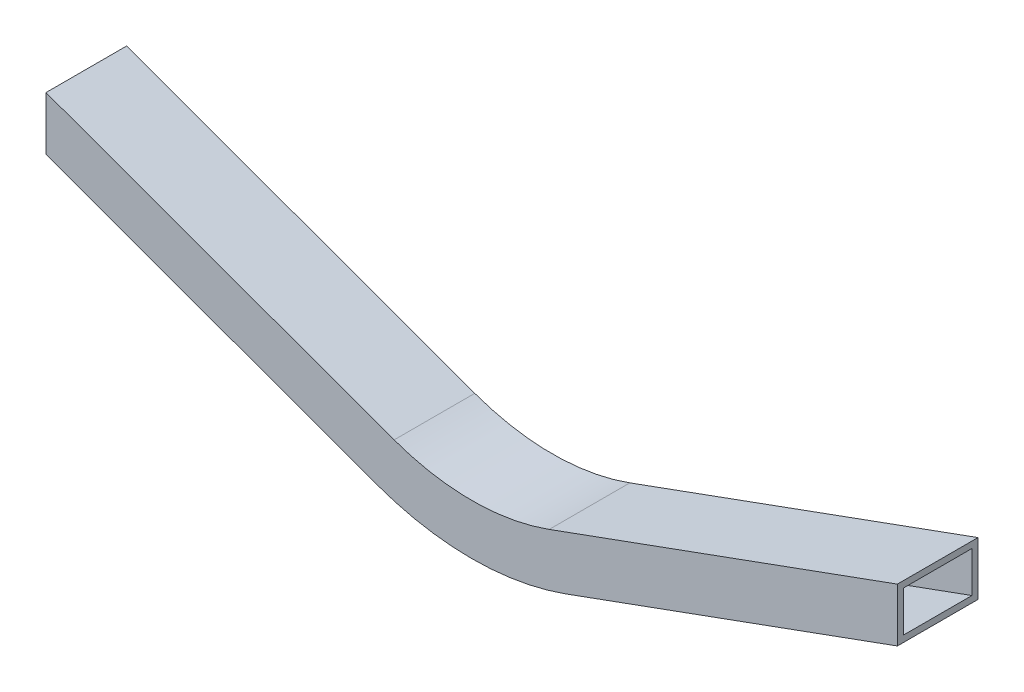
ISO-10303-21;
HEADER;
FILE_DESCRIPTION(('STEP AP214'),'2;1');
FILE_NAME('part.step','',(''),(''),'','','');
FILE_SCHEMA(('AUTOMOTIVE_DESIGN { 1 0 10303 214 1 1 1 1 }'));
ENDSEC;
DATA;
#1=APPLICATION_CONTEXT('core data for automotive mechanical design processes');
#2=APPLICATION_PROTOCOL_DEFINITION('international standard','automotive_design',2000,#1);
#3=PRODUCT_CONTEXT('',#1,'mechanical');
#4=PRODUCT('Part','Part','',(#3));
#5=PRODUCT_RELATED_PRODUCT_CATEGORY('part','',(#4));
#6=PRODUCT_DEFINITION_FORMATION('','',#4);
#7=PRODUCT_DEFINITION_CONTEXT('part definition',#1,'design');
#8=PRODUCT_DEFINITION('design','',#6,#7);
#9=PRODUCT_DEFINITION_SHAPE('','',#8);
#10=(LENGTH_UNIT() NAMED_UNIT(*) SI_UNIT(.MILLI.,.METRE.));
#11=(NAMED_UNIT(*) PLANE_ANGLE_UNIT() SI_UNIT($,.RADIAN.));
#12=(NAMED_UNIT(*) SI_UNIT($,.STERADIAN.) SOLID_ANGLE_UNIT());
#13=UNCERTAINTY_MEASURE_WITH_UNIT(LENGTH_MEASURE(1.E-05),#10,'distance_accuracy_value','');
#14=(GEOMETRIC_REPRESENTATION_CONTEXT(3) GLOBAL_UNCERTAINTY_ASSIGNED_CONTEXT((#13)) GLOBAL_UNIT_ASSIGNED_CONTEXT((#10,
#11,#12)) REPRESENTATION_CONTEXT('',''));
#15=CARTESIAN_POINT('',(0.,0.,0.));
#16=DIRECTION('',(0.,0.,1.));
#17=DIRECTION('',(1.,0.,0.));
#18=AXIS2_PLACEMENT_3D('',#15,#16,#17);
#19=CARTESIAN_POINT('',(76.9545322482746,54.6136034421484,-40.));
#20=DIRECTION('',(0.342020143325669,-0.939692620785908,0.));
#21=DIRECTION('',(0.939692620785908,0.342020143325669,0.));
#22=AXIS2_PLACEMENT_3D('',#19,#20,#21);
#23=PLANE('',#22);
#24=DIRECTION('',(0.,0.,1.));
#25=VECTOR('',#24,1.);
#26=CARTESIAN_POINT('',(422.499999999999,180.381868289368,-40.));
#27=LINE('',#26,#25);
#28=CARTESIAN_POINT('',(422.499999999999,180.381868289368,-40.));
#29=VERTEX_POINT('',#28);
#30=CARTESIAN_POINT('',(422.499999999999,180.381868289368,40.));
#31=VERTEX_POINT('',#30);
#32=EDGE_CURVE('E366',#29,#31,#27,.T.);
#33=ORIENTED_EDGE('',*,*,#32,.F.);
#34=DIRECTION('',(0.939692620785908,0.342020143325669,0.));
#35=VECTOR('',#34,1.);
#36=CARTESIAN_POINT('',(76.9545322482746,54.6136034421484,-40.));
#37=LINE('',#36,#35);
#38=CARTESIAN_POINT('',(76.9545322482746,54.6136034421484,-40.));
#39=VERTEX_POINT('',#38);
#40=EDGE_CURVE('E523',#39,#29,#37,.T.);
#41=ORIENTED_EDGE('',*,*,#40,.F.);
#42=DIRECTION('',(0.,0.,-1.));
#43=VECTOR('',#42,1.);
#44=CARTESIAN_POINT('',(76.9545322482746,54.6136034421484,-40.));
#45=LINE('',#44,#43);
#46=CARTESIAN_POINT('',(76.9545322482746,54.6136034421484,40.));
#47=VERTEX_POINT('',#46);
#48=EDGE_CURVE('E501',#47,#39,#45,.T.);
#49=ORIENTED_EDGE('',*,*,#48,.F.);
#50=DIRECTION('',(0.939692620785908,0.342020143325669,0.));
#51=VECTOR('',#50,1.);
#52=CARTESIAN_POINT('',(76.9545322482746,54.6136034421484,40.));
#53=LINE('',#52,#51);
#54=EDGE_CURVE('E520',#47,#31,#53,.T.);
#55=ORIENTED_EDGE('',*,*,#54,.T.);
#56=EDGE_LOOP('',(#33,#41,#49,#55));
#57=FACE_BOUND('',#56,.T.);
#58=ADVANCED_FACE('F352',(#57),#23,.F.);
#59=CARTESIAN_POINT('',(94.0555394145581,7.62897240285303,-40.));
#60=DIRECTION('',(-0.342020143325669,0.939692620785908,0.));
#61=DIRECTION('',(-0.939692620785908,-0.342020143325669,0.));
#62=AXIS2_PLACEMENT_3D('',#59,#60,#61);
#63=PLANE('',#62);
#64=DIRECTION('',(0.,0.,-1.));
#65=VECTOR('',#64,1.);
#66=CARTESIAN_POINT('',(422.499999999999,127.172979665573,-40.));
#67=LINE('',#66,#65);
#68=CARTESIAN_POINT('',(422.499999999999,127.172979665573,40.));
#69=VERTEX_POINT('',#68);
#70=CARTESIAN_POINT('',(422.499999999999,127.172979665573,-40.));
#71=VERTEX_POINT('',#70);
#72=EDGE_CURVE('E586',#69,#71,#67,.T.);
#73=ORIENTED_EDGE('',*,*,#72,.F.);
#74=DIRECTION('',(0.939692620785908,0.342020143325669,0.));
#75=VECTOR('',#74,1.);
#76=CARTESIAN_POINT('',(94.0555394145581,7.62897240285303,40.));
#77=LINE('',#76,#75);
#78=CARTESIAN_POINT('',(94.0555394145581,7.62897240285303,40.));
#79=VERTEX_POINT('',#78);
#80=EDGE_CURVE('E517',#79,#69,#77,.T.);
#81=ORIENTED_EDGE('',*,*,#80,.F.);
#82=DIRECTION('',(0.,0.,1.));
#83=VECTOR('',#82,1.);
#84=CARTESIAN_POINT('',(94.0555394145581,7.62897240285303,-40.));
#85=LINE('',#84,#83);
#86=CARTESIAN_POINT('',(94.0555394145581,7.62897240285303,-40.));
#87=VERTEX_POINT('',#86);
#88=EDGE_CURVE('E490',#87,#79,#85,.T.);
#89=ORIENTED_EDGE('',*,*,#88,.F.);
#90=DIRECTION('',(0.939692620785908,0.342020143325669,0.));
#91=VECTOR('',#90,1.);
#92=CARTESIAN_POINT('',(94.0555394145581,7.62897240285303,-40.));
#93=LINE('',#92,#91);
#94=EDGE_CURVE('E514',#87,#71,#93,.T.);
#95=ORIENTED_EDGE('',*,*,#94,.T.);
#96=EDGE_LOOP('',(#73,#81,#89,#95));
#97=FACE_BOUND('',#96,.T.);
#98=ADVANCED_FACE('F644',(#97),#63,.F.);
#99=CARTESIAN_POINT('',(-76.9545322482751,54.6136034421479,-40.));
#100=DIRECTION('',(0.,0.,-1.));
#101=DIRECTION('',(0.,1.,0.));
#102=AXIS2_PLACEMENT_3D('',#99,#100,#101);
#103=PLANE('',#102);
#104=DIRECTION('',(-0.939692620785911,0.342020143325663,0.));
#105=VECTOR('',#104,1.);
#106=CARTESIAN_POINT('',(-94.0555394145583,7.62897240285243,-40.));
#107=LINE('',#106,#105);
#108=CARTESIAN_POINT('',(-94.0555394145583,7.62897240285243,-40.));
#109=VERTEX_POINT('',#108);
#110=CARTESIAN_POINT('',(-422.500000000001,127.17297966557,-40.));
#111=VERTEX_POINT('',#110);
#112=EDGE_CURVE('E492',#109,#111,#107,.T.);
#113=ORIENTED_EDGE('',*,*,#112,.T.);
#114=DIRECTION('',(0.,-1.,0.));
#115=VECTOR('',#114,1.);
#116=CARTESIAN_POINT('',(-422.500000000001,372.439072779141,-40.));
#117=LINE('',#116,#115);
#118=CARTESIAN_POINT('',(-422.500000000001,180.381868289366,-40.));
#119=VERTEX_POINT('',#118);
#120=EDGE_CURVE('E374',#119,#111,#117,.T.);
#121=ORIENTED_EDGE('',*,*,#120,.F.);
#122=DIRECTION('',(-0.939692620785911,0.342020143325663,0.));
#123=VECTOR('',#122,1.);
#124=CARTESIAN_POINT('',(-76.9545322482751,54.6136034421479,-40.));
#125=LINE('',#124,#123);
#126=CARTESIAN_POINT('',(-76.9545322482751,54.6136034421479,-40.));
#127=VERTEX_POINT('',#126);
#128=EDGE_CURVE('E481',#127,#119,#125,.T.);
#129=ORIENTED_EDGE('',*,*,#128,.F.);
#130=CARTESIAN_POINT('',(-9.59302082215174E-13,266.044443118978,-40.));
#131=DIRECTION('',(0.,0.,1.));
#132=DIRECTION('',(1.,0.,0.));
#133=AXIS2_PLACEMENT_3D('',#130,#131,#132);
#134=CIRCLE('',#133,225.);
#135=EDGE_CURVE('E511',#127,#39,#134,.T.);
#136=ORIENTED_EDGE('',*,*,#135,.T.);
#137=ORIENTED_EDGE('',*,*,#40,.T.);
#138=DIRECTION('',(0.,1.,0.));
#139=VECTOR('',#138,1.);
#140=CARTESIAN_POINT('',(422.499999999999,372.439072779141,-40.));
#141=LINE('',#140,#139);
#142=EDGE_CURVE('E543',#71,#29,#141,.T.);
#143=ORIENTED_EDGE('',*,*,#142,.F.);
#144=ORIENTED_EDGE('',*,*,#94,.F.);
#145=CARTESIAN_POINT('',(-9.59302082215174E-13,266.044443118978,-40.));
#146=DIRECTION('',(0.,0.,1.));
#147=DIRECTION('',(1.,0.,0.));
#148=AXIS2_PLACEMENT_3D('',#145,#146,#147);
#149=CIRCLE('',#148,275.);
#150=EDGE_CURVE('E504',#109,#87,#149,.T.);
#151=ORIENTED_EDGE('',*,*,#150,.F.);
#152=EDGE_LOOP('',(#113,#121,#129,#136,#137,#143,#144,#151));
#153=FACE_BOUND('',#152,.T.);
#154=ADVANCED_FACE('F568',(#153),#103,.T.);
#155=CARTESIAN_POINT('',(-76.9545322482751,54.6136034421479,-40.));
#156=DIRECTION('',(0.342020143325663,0.939692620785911,0.));
#157=DIRECTION('',(-0.939692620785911,0.342020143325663,0.));
#158=AXIS2_PLACEMENT_3D('',#155,#156,#157);
#159=PLANE('',#158);
#160=ORIENTED_EDGE('',*,*,#128,.T.);
#161=DIRECTION('',(0.,0.,1.));
#162=VECTOR('',#161,1.);
#163=CARTESIAN_POINT('',(-422.500000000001,180.381868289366,-40.));
#164=LINE('',#163,#162);
#165=CARTESIAN_POINT('',(-422.500000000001,180.381868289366,40.));
#166=VERTEX_POINT('',#165);
#167=EDGE_CURVE('E466',#119,#166,#164,.T.);
#168=ORIENTED_EDGE('',*,*,#167,.T.);
#169=DIRECTION('',(-0.939692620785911,0.342020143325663,0.));
#170=VECTOR('',#169,1.);
#171=CARTESIAN_POINT('',(-76.9545322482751,54.6136034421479,40.));
#172=LINE('',#171,#170);
#173=CARTESIAN_POINT('',(-76.9545322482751,54.6136034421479,40.));
#174=VERTEX_POINT('',#173);
#175=EDGE_CURVE('E479',#174,#166,#172,.T.);
#176=ORIENTED_EDGE('',*,*,#175,.F.);
#177=DIRECTION('',(0.,0.,-1.));
#178=VECTOR('',#177,1.);
#179=CARTESIAN_POINT('',(-76.9545322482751,54.6136034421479,-40.));
#180=LINE('',#179,#178);
#181=EDGE_CURVE('E498',#174,#127,#180,.T.);
#182=ORIENTED_EDGE('',*,*,#181,.T.);
#183=EDGE_LOOP('',(#160,#168,#176,#182));
#184=FACE_BOUND('',#183,.T.);
#185=ADVANCED_FACE('F477',(#184),#159,.T.);
#186=CARTESIAN_POINT('',(-76.9545322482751,54.6136034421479,40.));
#187=DIRECTION('',(0.,0.,1.));
#188=DIRECTION('',(1.,0.,0.));
#189=AXIS2_PLACEMENT_3D('',#186,#187,#188);
#190=PLANE('',#189);
#191=ORIENTED_EDGE('',*,*,#175,.T.);
#192=DIRECTION('',(0.,-1.,0.));
#193=VECTOR('',#192,1.);
#194=CARTESIAN_POINT('',(-422.500000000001,372.439072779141,40.));
#195=LINE('',#194,#193);
#196=CARTESIAN_POINT('',(-422.500000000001,127.17297966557,40.));
#197=VERTEX_POINT('',#196);
#198=EDGE_CURVE('E462',#166,#197,#195,.T.);
#199=ORIENTED_EDGE('',*,*,#198,.T.);
#200=DIRECTION('',(-0.939692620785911,0.342020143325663,0.));
#201=VECTOR('',#200,1.);
#202=CARTESIAN_POINT('',(-94.0555394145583,7.62897240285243,40.));
#203=LINE('',#202,#201);
#204=CARTESIAN_POINT('',(-94.0555394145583,7.62897240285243,40.));
#205=VERTEX_POINT('',#204);
#206=EDGE_CURVE('E488',#205,#197,#203,.T.);
#207=ORIENTED_EDGE('',*,*,#206,.F.);
#208=CARTESIAN_POINT('',(-9.59302082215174E-13,266.044443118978,40.));
#209=DIRECTION('',(0.,0.,1.));
#210=DIRECTION('',(1.,0.,0.));
#211=AXIS2_PLACEMENT_3D('',#208,#209,#210);
#212=CIRCLE('',#211,275.);
#213=EDGE_CURVE('E507',#205,#79,#212,.T.);
#214=ORIENTED_EDGE('',*,*,#213,.T.);
#215=ORIENTED_EDGE('',*,*,#80,.T.);
#216=DIRECTION('',(0.,1.,0.));
#217=VECTOR('',#216,1.);
#218=CARTESIAN_POINT('',(422.499999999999,372.439072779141,40.));
#219=LINE('',#218,#217);
#220=EDGE_CURVE('E472',#69,#31,#219,.T.);
#221=ORIENTED_EDGE('',*,*,#220,.T.);
#222=ORIENTED_EDGE('',*,*,#54,.F.);
#223=CARTESIAN_POINT('',(-9.59302082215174E-13,266.044443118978,40.));
#224=DIRECTION('',(0.,0.,1.));
#225=DIRECTION('',(1.,0.,0.));
#226=AXIS2_PLACEMENT_3D('',#223,#224,#225);
#227=CIRCLE('',#226,225.);
#228=EDGE_CURVE('E486',#174,#47,#227,.T.);
#229=ORIENTED_EDGE('',*,*,#228,.F.);
#230=EDGE_LOOP('',(#191,#199,#207,#214,#215,#221,#222,#229));
#231=FACE_BOUND('',#230,.T.);
#232=ADVANCED_FACE('F484',(#231),#190,.T.);
#233=CARTESIAN_POINT('',(-94.0555394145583,7.62897240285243,-40.));
#234=DIRECTION('',(-0.342020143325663,-0.939692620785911,0.));
#235=DIRECTION('',(0.939692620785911,-0.342020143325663,0.));
#236=AXIS2_PLACEMENT_3D('',#233,#234,#235);
#237=PLANE('',#236);
#238=ORIENTED_EDGE('',*,*,#206,.T.);
#239=DIRECTION('',(0.,0.,-1.));
#240=VECTOR('',#239,1.);
#241=CARTESIAN_POINT('',(-422.500000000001,127.17297966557,-40.));
#242=LINE('',#241,#240);
#243=EDGE_CURVE('E467',#197,#111,#242,.T.);
#244=ORIENTED_EDGE('',*,*,#243,.T.);
#245=ORIENTED_EDGE('',*,*,#112,.F.);
#246=DIRECTION('',(0.,0.,1.));
#247=VECTOR('',#246,1.);
#248=CARTESIAN_POINT('',(-94.0555394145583,7.62897240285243,-40.));
#249=LINE('',#248,#247);
#250=EDGE_CURVE('E561',#109,#205,#249,.T.);
#251=ORIENTED_EDGE('',*,*,#250,.T.);
#252=EDGE_LOOP('',(#238,#244,#245,#251));
#253=FACE_BOUND('',#252,.T.);
#254=ADVANCED_FACE('F658',(#253),#237,.T.);
#255=CARTESIAN_POINT('',(-9.59302082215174E-13,266.044443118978,0.));
#256=DIRECTION('',(0.,0.,1.));
#257=DIRECTION('',(1.,0.,0.));
#258=AXIS2_PLACEMENT_3D('',#255,#256,#257);
#259=CYLINDRICAL_SURFACE('',#258,225.);
#260=ORIENTED_EDGE('',*,*,#181,.F.);
#261=ORIENTED_EDGE('',*,*,#228,.T.);
#262=ORIENTED_EDGE('',*,*,#48,.T.);
#263=ORIENTED_EDGE('',*,*,#135,.F.);
#264=EDGE_LOOP('',(#260,#261,#262,#263));
#265=FACE_BOUND('',#264,.T.);
#266=ADVANCED_FACE('F565',(#265),#259,.F.);
#267=CARTESIAN_POINT('',(-9.59302082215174E-13,266.044443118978,0.));
#268=DIRECTION('',(0.,0.,1.));
#269=DIRECTION('',(1.,0.,0.));
#270=AXIS2_PLACEMENT_3D('',#267,#268,#269);
#271=CYLINDRICAL_SURFACE('',#270,275.);
#272=ORIENTED_EDGE('',*,*,#250,.F.);
#273=ORIENTED_EDGE('',*,*,#150,.T.);
#274=ORIENTED_EDGE('',*,*,#88,.T.);
#275=ORIENTED_EDGE('',*,*,#213,.F.);
#276=EDGE_LOOP('',(#272,#273,#274,#275));
#277=FACE_BOUND('',#276,.T.);
#278=ADVANCED_FACE('F656',(#277),#271,.T.);
#279=CARTESIAN_POINT('',(-422.500000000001,372.439072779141,-40.));
#280=DIRECTION('',(-1.,0.,0.));
#281=DIRECTION('',(0.,-1.,0.));
#282=AXIS2_PLACEMENT_3D('',#279,#280,#281);
#283=PLANE('',#282);
#284=ORIENTED_EDGE('',*,*,#120,.T.);
#285=ORIENTED_EDGE('',*,*,#243,.F.);
#286=ORIENTED_EDGE('',*,*,#198,.F.);
#287=ORIENTED_EDGE('',*,*,#167,.F.);
#288=EDGE_LOOP('',(#284,#285,#286,#287));
#289=FACE_BOUND('',#288,.T.);
#290=DIRECTION('',(0.,0.,1.));
#291=VECTOR('',#290,1.);
#292=CARTESIAN_POINT('',(-422.500000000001,173.99680165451,-40.));
#293=LINE('',#292,#291);
#294=CARTESIAN_POINT('',(-422.500000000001,173.99680165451,-34.));
#295=VERTEX_POINT('',#294);
#296=CARTESIAN_POINT('',(-422.500000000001,173.99680165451,34.));
#297=VERTEX_POINT('',#296);
#298=EDGE_CURVE('E575',#295,#297,#293,.T.);
#299=ORIENTED_EDGE('',*,*,#298,.T.);
#300=DIRECTION('',(0.,1.,0.));
#301=VECTOR('',#300,1.);
#302=CARTESIAN_POINT('',(-422.500000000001,54.6136034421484,34.));
#303=LINE('',#302,#301);
#304=CARTESIAN_POINT('',(-422.500000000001,133.558046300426,34.));
#305=VERTEX_POINT('',#304);
#306=EDGE_CURVE('E530',#305,#297,#303,.T.);
#307=ORIENTED_EDGE('',*,*,#306,.F.);
#308=DIRECTION('',(0.,0.,-1.));
#309=VECTOR('',#308,1.);
#310=CARTESIAN_POINT('',(-422.500000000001,133.558046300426,-40.));
#311=LINE('',#310,#309);
#312=CARTESIAN_POINT('',(-422.500000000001,133.558046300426,-34.));
#313=VERTEX_POINT('',#312);
#314=EDGE_CURVE('E359',#305,#313,#311,.T.);
#315=ORIENTED_EDGE('',*,*,#314,.T.);
#316=DIRECTION('',(0.,-1.,0.));
#317=VECTOR('',#316,1.);
#318=CARTESIAN_POINT('',(-422.500000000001,54.6136034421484,-34.0000000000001));
#319=LINE('',#318,#317);
#320=EDGE_CURVE('E527',#295,#313,#319,.T.);
#321=ORIENTED_EDGE('',*,*,#320,.F.);
#322=EDGE_LOOP('',(#299,#307,#315,#321));
#323=FACE_BOUND('',#322,.T.);
#324=ADVANCED_FACE('F464',(#289,#323),#283,.T.);
#325=CARTESIAN_POINT('',(422.499999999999,372.439072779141,-40.));
#326=DIRECTION('',(1.,0.,0.));
#327=DIRECTION('',(0.,1.,0.));
#328=AXIS2_PLACEMENT_3D('',#325,#326,#327);
#329=PLANE('',#328);
#330=DIRECTION('',(0.,1.,0.));
#331=VECTOR('',#330,1.);
#332=CARTESIAN_POINT('',(422.499999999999,54.6136034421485,-34.));
#333=LINE('',#332,#331);
#334=CARTESIAN_POINT('',(422.499999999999,133.558046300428,-34.));
#335=VERTEX_POINT('',#334);
#336=CARTESIAN_POINT('',(422.499999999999,173.996801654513,-34.));
#337=VERTEX_POINT('',#336);
#338=EDGE_CURVE('E12',#335,#337,#333,.T.);
#339=ORIENTED_EDGE('',*,*,#338,.F.);
#340=DIRECTION('',(0.,0.,-1.));
#341=VECTOR('',#340,1.);
#342=CARTESIAN_POINT('',(422.499999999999,133.558046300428,-40.));
#343=LINE('',#342,#341);
#344=CARTESIAN_POINT('',(422.499999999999,133.558046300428,34.));
#345=VERTEX_POINT('',#344);
#346=EDGE_CURVE('E482',#345,#335,#343,.T.);
#347=ORIENTED_EDGE('',*,*,#346,.F.);
#348=DIRECTION('',(0.,-1.,0.));
#349=VECTOR('',#348,1.);
#350=CARTESIAN_POINT('',(422.499999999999,54.6136034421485,34.));
#351=LINE('',#350,#349);
#352=CARTESIAN_POINT('',(422.499999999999,173.996801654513,34.));
#353=VERTEX_POINT('',#352);
#354=EDGE_CURVE('E580',#353,#345,#351,.T.);
#355=ORIENTED_EDGE('',*,*,#354,.F.);
#356=DIRECTION('',(0.,0.,1.));
#357=VECTOR('',#356,1.);
#358=CARTESIAN_POINT('',(422.499999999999,173.996801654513,-40.));
#359=LINE('',#358,#357);
#360=EDGE_CURVE('E583',#337,#353,#359,.T.);
#361=ORIENTED_EDGE('',*,*,#360,.F.);
#362=EDGE_LOOP('',(#339,#347,#355,#361));
#363=FACE_BOUND('',#362,.T.);
#364=ORIENTED_EDGE('',*,*,#32,.T.);
#365=ORIENTED_EDGE('',*,*,#220,.F.);
#366=ORIENTED_EDGE('',*,*,#72,.T.);
#367=ORIENTED_EDGE('',*,*,#142,.T.);
#368=EDGE_LOOP('',(#364,#365,#366,#367));
#369=FACE_BOUND('',#368,.T.);
#370=ADVANCED_FACE('F622',(#363,#369),#329,.T.);
#371=CARTESIAN_POINT('',(-9.59302082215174E-13,266.044443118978,0.));
#372=DIRECTION('',(0.,0.,1.));
#373=DIRECTION('',(1.,0.,0.));
#374=AXIS2_PLACEMENT_3D('',#371,#372,#373);
#375=CYLINDRICAL_SURFACE('',#374,231.);
#376=DIRECTION('',(0.,0.,1.));
#377=VECTOR('',#376,1.);
#378=CARTESIAN_POINT('',(-79.0066531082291,48.9754477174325,-40.));
#379=LINE('',#378,#377);
#380=CARTESIAN_POINT('',(-79.0066531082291,48.9754477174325,34.));
#381=VERTEX_POINT('',#380);
#382=CARTESIAN_POINT('',(-79.0066531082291,48.9754477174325,-34.));
#383=VERTEX_POINT('',#382);
#384=EDGE_CURVE('E550',#381,#383,#379,.F.);
#385=ORIENTED_EDGE('',*,*,#384,.T.);
#386=CARTESIAN_POINT('',(-9.59302082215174E-13,266.044443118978,-34.));
#387=DIRECTION('',(0.,0.,1.));
#388=DIRECTION('',(1.,0.,0.));
#389=AXIS2_PLACEMENT_3D('',#386,#387,#388);
#390=CIRCLE('',#389,231.);
#391=CARTESIAN_POINT('',(79.0066531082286,48.975447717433,-34.));
#392=VERTEX_POINT('',#391);
#393=EDGE_CURVE('E606',#383,#392,#390,.T.);
#394=ORIENTED_EDGE('',*,*,#393,.T.);
#395=DIRECTION('',(0.,0.,1.));
#396=VECTOR('',#395,1.);
#397=CARTESIAN_POINT('',(79.0066531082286,48.9754477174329,0.));
#398=LINE('',#397,#396);
#399=CARTESIAN_POINT('',(79.0066531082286,48.975447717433,34.));
#400=VERTEX_POINT('',#399);
#401=EDGE_CURVE('E589',#400,#392,#398,.F.);
#402=ORIENTED_EDGE('',*,*,#401,.F.);
#403=CARTESIAN_POINT('',(-9.59302082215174E-13,266.044443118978,34.));
#404=DIRECTION('',(0.,0.,-1.));
#405=DIRECTION('',(-1.,0.,0.));
#406=AXIS2_PLACEMENT_3D('',#403,#404,#405);
#407=CIRCLE('',#406,231.);
#408=EDGE_CURVE('E608',#381,#400,#407,.F.);
#409=ORIENTED_EDGE('',*,*,#408,.F.);
#410=EDGE_LOOP('',(#385,#394,#402,#409));
#411=FACE_BOUND('',#410,.T.);
#412=ADVANCED_FACE('F630',(#411),#375,.T.);
#413=CARTESIAN_POINT('',(-9.59302082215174E-13,266.044443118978,0.));
#414=DIRECTION('',(0.,0.,1.));
#415=DIRECTION('',(1.,0.,0.));
#416=AXIS2_PLACEMENT_3D('',#413,#414,#415);
#417=CYLINDRICAL_SURFACE('',#416,269.);
#418=DIRECTION('',(0.,0.,1.));
#419=VECTOR('',#418,1.);
#420=CARTESIAN_POINT('',(-92.0034185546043,13.2671281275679,-40.));
#421=LINE('',#420,#419);
#422=CARTESIAN_POINT('',(-92.0034185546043,13.2671281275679,-34.));
#423=VERTEX_POINT('',#422);
#424=CARTESIAN_POINT('',(-92.0034185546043,13.2671281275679,34.));
#425=VERTEX_POINT('',#424);
#426=EDGE_CURVE('E548',#423,#425,#421,.T.);
#427=ORIENTED_EDGE('',*,*,#426,.T.);
#428=CARTESIAN_POINT('',(-9.59302082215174E-13,266.044443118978,34.));
#429=DIRECTION('',(0.,0.,-1.));
#430=DIRECTION('',(-1.,0.,0.));
#431=AXIS2_PLACEMENT_3D('',#428,#429,#430);
#432=CIRCLE('',#431,269.);
#433=CARTESIAN_POINT('',(92.0034185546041,13.2671281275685,34.));
#434=VERTEX_POINT('',#433);
#435=EDGE_CURVE('E611',#425,#434,#432,.F.);
#436=ORIENTED_EDGE('',*,*,#435,.T.);
#437=DIRECTION('',(0.,0.,1.));
#438=VECTOR('',#437,1.);
#439=CARTESIAN_POINT('',(92.003418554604,13.2671281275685,0.));
#440=LINE('',#439,#438);
#441=CARTESIAN_POINT('',(92.0034185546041,13.2671281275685,-34.));
#442=VERTEX_POINT('',#441);
#443=EDGE_CURVE('E593',#442,#434,#440,.T.);
#444=ORIENTED_EDGE('',*,*,#443,.F.);
#445=CARTESIAN_POINT('',(-9.59302082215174E-13,266.044443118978,-34.));
#446=DIRECTION('',(0.,0.,1.));
#447=DIRECTION('',(1.,0.,0.));
#448=AXIS2_PLACEMENT_3D('',#445,#446,#447);
#449=CIRCLE('',#448,269.);
#450=EDGE_CURVE('E592',#423,#442,#449,.T.);
#451=ORIENTED_EDGE('',*,*,#450,.F.);
#452=EDGE_LOOP('',(#427,#436,#444,#451));
#453=FACE_BOUND('',#452,.T.);
#454=ADVANCED_FACE('F618',(#453),#417,.F.);
#455=CARTESIAN_POINT('',(-92.0034185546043,13.2671281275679,-40.));
#456=DIRECTION('',(-0.342020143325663,-0.939692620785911,0.));
#457=DIRECTION('',(0.939692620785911,-0.342020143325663,0.));
#458=AXIS2_PLACEMENT_3D('',#455,#456,#457);
#459=PLANE('',#458);
#460=ORIENTED_EDGE('',*,*,#314,.F.);
#461=DIRECTION('',(-0.939692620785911,0.342020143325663,0.));
#462=VECTOR('',#461,1.);
#463=CARTESIAN_POINT('',(-92.0034185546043,13.2671281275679,34.));
#464=LINE('',#463,#462);
#465=EDGE_CURVE('E549',#425,#305,#464,.T.);
#466=ORIENTED_EDGE('',*,*,#465,.F.);
#467=ORIENTED_EDGE('',*,*,#426,.F.);
#468=DIRECTION('',(-0.939692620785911,0.342020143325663,0.));
#469=VECTOR('',#468,1.);
#470=CARTESIAN_POINT('',(-92.0034185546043,13.2671281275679,-34.));
#471=LINE('',#470,#469);
#472=EDGE_CURVE('E540',#423,#313,#471,.T.);
#473=ORIENTED_EDGE('',*,*,#472,.T.);
#474=EDGE_LOOP('',(#460,#466,#467,#473));
#475=FACE_BOUND('',#474,.T.);
#476=ADVANCED_FACE('F546',(#475),#459,.F.);
#477=CARTESIAN_POINT('',(-79.0066531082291,48.9754477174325,-40.));
#478=DIRECTION('',(0.342020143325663,0.939692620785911,0.));
#479=DIRECTION('',(-0.939692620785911,0.342020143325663,0.));
#480=AXIS2_PLACEMENT_3D('',#477,#478,#479);
#481=PLANE('',#480);
#482=ORIENTED_EDGE('',*,*,#298,.F.);
#483=DIRECTION('',(-0.939692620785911,0.342020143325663,0.));
#484=VECTOR('',#483,1.);
#485=CARTESIAN_POINT('',(-79.0066531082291,48.9754477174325,-34.));
#486=LINE('',#485,#484);
#487=EDGE_CURVE('E542',#383,#295,#486,.T.);
#488=ORIENTED_EDGE('',*,*,#487,.F.);
#489=ORIENTED_EDGE('',*,*,#384,.F.);
#490=DIRECTION('',(-0.939692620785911,0.342020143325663,0.));
#491=VECTOR('',#490,1.);
#492=CARTESIAN_POINT('',(-79.0066531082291,48.9754477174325,34.));
#493=LINE('',#492,#491);
#494=EDGE_CURVE('E552',#381,#297,#493,.T.);
#495=ORIENTED_EDGE('',*,*,#494,.T.);
#496=EDGE_LOOP('',(#482,#488,#489,#495));
#497=FACE_BOUND('',#496,.T.);
#498=ADVANCED_FACE('F633',(#497),#481,.F.);
#499=CARTESIAN_POINT('',(76.9545322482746,54.6136034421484,-34.));
#500=DIRECTION('',(0.,0.,1.));
#501=DIRECTION('',(0.,-1.,0.));
#502=AXIS2_PLACEMENT_3D('',#499,#500,#501);
#503=PLANE('',#502);
#504=ORIENTED_EDGE('',*,*,#487,.T.);
#505=ORIENTED_EDGE('',*,*,#320,.T.);
#506=ORIENTED_EDGE('',*,*,#472,.F.);
#507=ORIENTED_EDGE('',*,*,#450,.T.);
#508=DIRECTION('',(0.939692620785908,0.342020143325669,0.));
#509=VECTOR('',#508,1.);
#510=CARTESIAN_POINT('',(92.0034185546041,13.2671281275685,-34.));
#511=LINE('',#510,#509);
#512=EDGE_CURVE('E602',#442,#335,#511,.T.);
#513=ORIENTED_EDGE('',*,*,#512,.T.);
#514=ORIENTED_EDGE('',*,*,#338,.T.);
#515=DIRECTION('',(0.939692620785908,0.342020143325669,0.));
#516=VECTOR('',#515,1.);
#517=CARTESIAN_POINT('',(79.0066531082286,48.975447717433,-34.));
#518=LINE('',#517,#516);
#519=EDGE_CURVE('E563',#392,#337,#518,.T.);
#520=ORIENTED_EDGE('',*,*,#519,.F.);
#521=ORIENTED_EDGE('',*,*,#393,.F.);
#522=EDGE_LOOP('',(#504,#505,#506,#507,#513,#514,#520,#521));
#523=FACE_BOUND('',#522,.T.);
#524=ADVANCED_FACE('F538',(#523),#503,.T.);
#525=CARTESIAN_POINT('',(92.0034185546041,13.2671281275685,-40.));
#526=DIRECTION('',(-0.342020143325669,0.939692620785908,0.));
#527=DIRECTION('',(-0.939692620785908,-0.342020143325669,0.));
#528=AXIS2_PLACEMENT_3D('',#525,#526,#527);
#529=PLANE('',#528);
#530=DIRECTION('',(0.939692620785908,0.342020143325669,0.));
#531=VECTOR('',#530,1.);
#532=CARTESIAN_POINT('',(92.0034185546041,13.2671281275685,34.));
#533=LINE('',#532,#531);
#534=EDGE_CURVE('E597',#434,#345,#533,.T.);
#535=ORIENTED_EDGE('',*,*,#534,.T.);
#536=ORIENTED_EDGE('',*,*,#346,.T.);
#537=ORIENTED_EDGE('',*,*,#512,.F.);
#538=ORIENTED_EDGE('',*,*,#443,.T.);
#539=EDGE_LOOP('',(#535,#536,#537,#538));
#540=FACE_BOUND('',#539,.T.);
#541=ADVANCED_FACE('F620',(#540),#529,.T.);
#542=CARTESIAN_POINT('',(76.9545322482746,54.6136034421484,34.));
#543=DIRECTION('',(0.,0.,-1.));
#544=DIRECTION('',(-1.,0.,0.));
#545=AXIS2_PLACEMENT_3D('',#542,#543,#544);
#546=PLANE('',#545);
#547=ORIENTED_EDGE('',*,*,#465,.T.);
#548=ORIENTED_EDGE('',*,*,#306,.T.);
#549=ORIENTED_EDGE('',*,*,#494,.F.);
#550=ORIENTED_EDGE('',*,*,#408,.T.);
#551=DIRECTION('',(0.939692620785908,0.342020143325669,0.));
#552=VECTOR('',#551,1.);
#553=CARTESIAN_POINT('',(79.0066531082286,48.975447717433,34.));
#554=LINE('',#553,#552);
#555=EDGE_CURVE('E594',#400,#353,#554,.T.);
#556=ORIENTED_EDGE('',*,*,#555,.T.);
#557=ORIENTED_EDGE('',*,*,#354,.T.);
#558=ORIENTED_EDGE('',*,*,#534,.F.);
#559=ORIENTED_EDGE('',*,*,#435,.F.);
#560=EDGE_LOOP('',(#547,#548,#549,#550,#556,#557,#558,#559));
#561=FACE_BOUND('',#560,.T.);
#562=ADVANCED_FACE('F624',(#561),#546,.T.);
#563=CARTESIAN_POINT('',(79.0066531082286,48.975447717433,-40.));
#564=DIRECTION('',(0.342020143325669,-0.939692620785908,0.));
#565=DIRECTION('',(0.939692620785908,0.342020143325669,0.));
#566=AXIS2_PLACEMENT_3D('',#563,#564,#565);
#567=PLANE('',#566);
#568=ORIENTED_EDGE('',*,*,#519,.T.);
#569=ORIENTED_EDGE('',*,*,#360,.T.);
#570=ORIENTED_EDGE('',*,*,#555,.F.);
#571=ORIENTED_EDGE('',*,*,#401,.T.);
#572=EDGE_LOOP('',(#568,#569,#570,#571));
#573=FACE_BOUND('',#572,.T.);
#574=ADVANCED_FACE('F628',(#573),#567,.T.);
#575=CLOSED_SHELL('',(#58,#98,#154,#185,#232,#254,#266,#278,#324,#370,#412,#454,#476,#498,#524,
#541,#562,#574));
#576=MANIFOLD_SOLID_BREP('B2',#575);
#577=ADVANCED_BREP_SHAPE_REPRESENTATION('',(#18,#576),#14);
#578=SHAPE_DEFINITION_REPRESENTATION(#9,#577);
ENDSEC;
END-ISO-10303-21;
